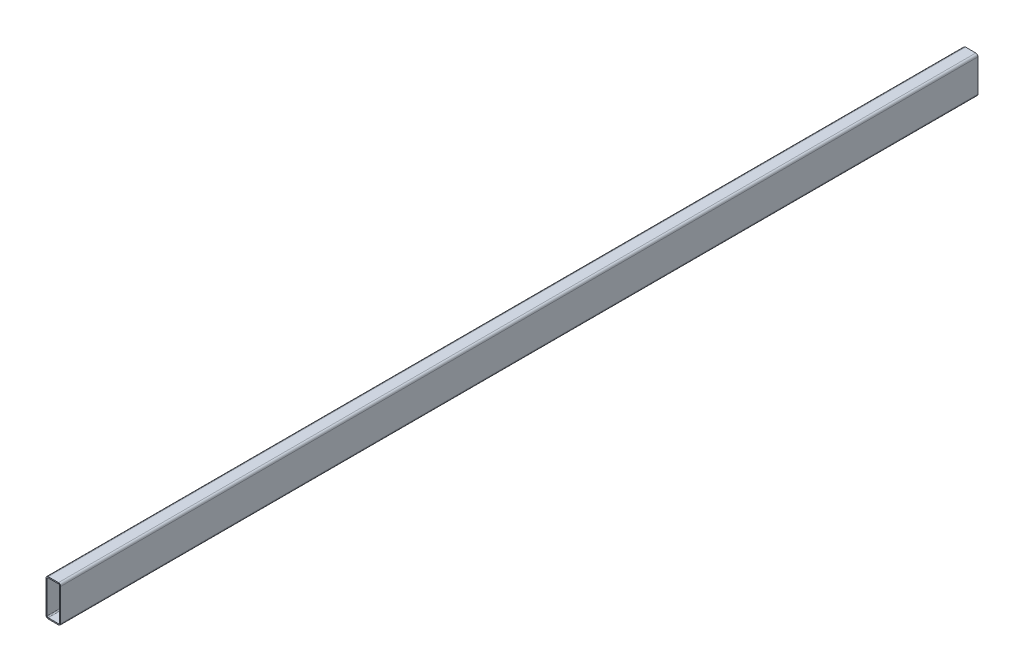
ISO-10303-21;
HEADER;
FILE_DESCRIPTION(('STEP AP214'),'2;1');
FILE_NAME('part.step','',(''),(''),'','','');
FILE_SCHEMA(('AUTOMOTIVE_DESIGN { 1 0 10303 214 1 1 1 1 }'));
ENDSEC;
DATA;
#1=APPLICATION_CONTEXT('core data for automotive mechanical design processes');
#2=APPLICATION_PROTOCOL_DEFINITION('international standard','automotive_design',2000,#1);
#3=PRODUCT_CONTEXT('',#1,'mechanical');
#4=PRODUCT('Part','Part','',(#3));
#5=PRODUCT_RELATED_PRODUCT_CATEGORY('part','',(#4));
#6=PRODUCT_DEFINITION_FORMATION('','',#4);
#7=PRODUCT_DEFINITION_CONTEXT('part definition',#1,'design');
#8=PRODUCT_DEFINITION('design','',#6,#7);
#9=PRODUCT_DEFINITION_SHAPE('','',#8);
#10=(LENGTH_UNIT() NAMED_UNIT(*) SI_UNIT(.MILLI.,.METRE.));
#11=(NAMED_UNIT(*) PLANE_ANGLE_UNIT() SI_UNIT($,.RADIAN.));
#12=(NAMED_UNIT(*) SI_UNIT($,.STERADIAN.) SOLID_ANGLE_UNIT());
#13=UNCERTAINTY_MEASURE_WITH_UNIT(LENGTH_MEASURE(1.E-05),#10,'distance_accuracy_value','');
#14=(GEOMETRIC_REPRESENTATION_CONTEXT(3) GLOBAL_UNCERTAINTY_ASSIGNED_CONTEXT((#13)) GLOBAL_UNIT_ASSIGNED_CONTEXT((#10,
#11,#12)) REPRESENTATION_CONTEXT('',''));
#15=CARTESIAN_POINT('',(0.,0.,0.));
#16=DIRECTION('',(0.,0.,1.));
#17=DIRECTION('',(1.,0.,0.));
#18=AXIS2_PLACEMENT_3D('',#15,#16,#17);
#19=CARTESIAN_POINT('',(6.,94.,2500.));
#20=DIRECTION('',(0.,0.,-1.));
#21=DIRECTION('',(-1.,0.,0.));
#22=AXIS2_PLACEMENT_3D('',#19,#20,#21);
#23=PLANE('',#22);
#24=CARTESIAN_POINT('',(6.,94.,2500.));
#25=DIRECTION('',(0.,0.,1.));
#26=DIRECTION('',(-1.,0.,0.));
#27=AXIS2_PLACEMENT_3D('',#24,#25,#26);
#28=CIRCLE('',#27,6.);
#29=CARTESIAN_POINT('',(6.00000000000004,100.,2500.));
#30=VERTEX_POINT('',#29);
#31=CARTESIAN_POINT('',(0.,94.,2500.));
#32=VERTEX_POINT('',#31);
#33=EDGE_CURVE('E217',#30,#32,#28,.T.);
#34=ORIENTED_EDGE('',*,*,#33,.T.);
#35=DIRECTION('',(0.,-1.,0.));
#36=VECTOR('',#35,1.);
#37=CARTESIAN_POINT('',(0.,6.00000000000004,2500.));
#38=LINE('',#37,#36);
#39=CARTESIAN_POINT('',(0.,6.00000000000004,2500.));
#40=VERTEX_POINT('',#39);
#41=EDGE_CURVE('E220',#32,#40,#38,.T.);
#42=ORIENTED_EDGE('',*,*,#41,.T.);
#43=CARTESIAN_POINT('',(6.,6.,2500.));
#44=DIRECTION('',(0.,0.,1.));
#45=DIRECTION('',(1.,0.,0.));
#46=AXIS2_PLACEMENT_3D('',#43,#44,#45);
#47=CIRCLE('',#46,6.);
#48=CARTESIAN_POINT('',(6.00000000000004,0.,2500.));
#49=VERTEX_POINT('',#48);
#50=EDGE_CURVE('E222',#40,#49,#47,.T.);
#51=ORIENTED_EDGE('',*,*,#50,.T.);
#52=DIRECTION('',(1.,0.,0.));
#53=VECTOR('',#52,1.);
#54=CARTESIAN_POINT('',(6.00000000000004,0.,2500.));
#55=LINE('',#54,#53);
#56=CARTESIAN_POINT('',(34.,0.,2500.));
#57=VERTEX_POINT('',#56);
#58=EDGE_CURVE('E224',#49,#57,#55,.T.);
#59=ORIENTED_EDGE('',*,*,#58,.T.);
#60=CARTESIAN_POINT('',(34.,6.,2500.));
#61=DIRECTION('',(0.,0.,1.));
#62=DIRECTION('',(1.,0.,0.));
#63=AXIS2_PLACEMENT_3D('',#60,#61,#62);
#64=CIRCLE('',#63,6.);
#65=CARTESIAN_POINT('',(40.,6.00000000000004,2500.));
#66=VERTEX_POINT('',#65);
#67=EDGE_CURVE('E226',#57,#66,#64,.T.);
#68=ORIENTED_EDGE('',*,*,#67,.T.);
#69=DIRECTION('',(0.,1.,0.));
#70=VECTOR('',#69,1.);
#71=CARTESIAN_POINT('',(40.,6.00000000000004,2500.));
#72=LINE('',#71,#70);
#73=CARTESIAN_POINT('',(40.,94.,2500.));
#74=VERTEX_POINT('',#73);
#75=EDGE_CURVE('E228',#66,#74,#72,.T.);
#76=ORIENTED_EDGE('',*,*,#75,.T.);
#77=CARTESIAN_POINT('',(34.,94.,2500.));
#78=DIRECTION('',(0.,0.,1.));
#79=DIRECTION('',(1.,0.,0.));
#80=AXIS2_PLACEMENT_3D('',#77,#78,#79);
#81=CIRCLE('',#80,6.);
#82=CARTESIAN_POINT('',(34.,100.,2500.));
#83=VERTEX_POINT('',#82);
#84=EDGE_CURVE('E230',#74,#83,#81,.T.);
#85=ORIENTED_EDGE('',*,*,#84,.T.);
#86=DIRECTION('',(-1.,0.,0.));
#87=VECTOR('',#86,1.);
#88=CARTESIAN_POINT('',(6.00000000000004,100.,2500.));
#89=LINE('',#88,#87);
#90=EDGE_CURVE('E232',#83,#30,#89,.T.);
#91=ORIENTED_EDGE('',*,*,#90,.T.);
#92=EDGE_LOOP('',(#34,#42,#51,#59,#68,#76,#85,#91));
#93=FACE_BOUND('',#92,.T.);
#94=CARTESIAN_POINT('',(6.,94.,2500.));
#95=DIRECTION('',(0.,0.,1.));
#96=DIRECTION('',(1.,0.,0.));
#97=AXIS2_PLACEMENT_3D('',#94,#95,#96);
#98=CIRCLE('',#97,3.);
#99=CARTESIAN_POINT('',(6.00000000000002,97.,2500.));
#100=VERTEX_POINT('',#99);
#101=CARTESIAN_POINT('',(3.,94.,2500.));
#102=VERTEX_POINT('',#101);
#103=EDGE_CURVE('E152',#100,#102,#98,.T.);
#104=ORIENTED_EDGE('',*,*,#103,.F.);
#105=DIRECTION('',(-1.,0.,0.));
#106=VECTOR('',#105,1.);
#107=CARTESIAN_POINT('',(6.00000000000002,97.,2500.));
#108=LINE('',#107,#106);
#109=CARTESIAN_POINT('',(34.,97.,2500.));
#110=VERTEX_POINT('',#109);
#111=EDGE_CURVE('E187',#110,#100,#108,.T.);
#112=ORIENTED_EDGE('',*,*,#111,.F.);
#113=CARTESIAN_POINT('',(34.,94.,2500.));
#114=DIRECTION('',(0.,0.,1.));
#115=DIRECTION('',(1.,0.,0.));
#116=AXIS2_PLACEMENT_3D('',#113,#114,#115);
#117=CIRCLE('',#116,3.);
#118=CARTESIAN_POINT('',(37.,94.,2500.));
#119=VERTEX_POINT('',#118);
#120=EDGE_CURVE('E185',#119,#110,#117,.T.);
#121=ORIENTED_EDGE('',*,*,#120,.F.);
#122=DIRECTION('',(0.,1.,0.));
#123=VECTOR('',#122,1.);
#124=CARTESIAN_POINT('',(37.,6.00000000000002,2500.));
#125=LINE('',#124,#123);
#126=CARTESIAN_POINT('',(37.,6.00000000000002,2500.));
#127=VERTEX_POINT('',#126);
#128=EDGE_CURVE('E183',#127,#119,#125,.T.);
#129=ORIENTED_EDGE('',*,*,#128,.F.);
#130=CARTESIAN_POINT('',(34.,6.,2500.));
#131=DIRECTION('',(0.,0.,1.));
#132=DIRECTION('',(1.,0.,0.));
#133=AXIS2_PLACEMENT_3D('',#130,#131,#132);
#134=CIRCLE('',#133,3.);
#135=CARTESIAN_POINT('',(34.,3.,2500.));
#136=VERTEX_POINT('',#135);
#137=EDGE_CURVE('E181',#136,#127,#134,.T.);
#138=ORIENTED_EDGE('',*,*,#137,.F.);
#139=DIRECTION('',(1.,0.,0.));
#140=VECTOR('',#139,1.);
#141=CARTESIAN_POINT('',(6.00000000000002,3.,2500.));
#142=LINE('',#141,#140);
#143=CARTESIAN_POINT('',(6.00000000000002,3.,2500.));
#144=VERTEX_POINT('',#143);
#145=EDGE_CURVE('E179',#144,#136,#142,.T.);
#146=ORIENTED_EDGE('',*,*,#145,.F.);
#147=CARTESIAN_POINT('',(6.,6.,2500.));
#148=DIRECTION('',(0.,0.,1.));
#149=DIRECTION('',(1.,0.,0.));
#150=AXIS2_PLACEMENT_3D('',#147,#148,#149);
#151=CIRCLE('',#150,3.);
#152=CARTESIAN_POINT('',(3.,6.00000000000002,2500.));
#153=VERTEX_POINT('',#152);
#154=EDGE_CURVE('E177',#153,#144,#151,.T.);
#155=ORIENTED_EDGE('',*,*,#154,.F.);
#156=DIRECTION('',(0.,-1.,0.));
#157=VECTOR('',#156,1.);
#158=CARTESIAN_POINT('',(3.,6.00000000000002,2500.));
#159=LINE('',#158,#157);
#160=EDGE_CURVE('E175',#102,#153,#159,.T.);
#161=ORIENTED_EDGE('',*,*,#160,.F.);
#162=EDGE_LOOP('',(#104,#112,#121,#129,#138,#146,#155,#161));
#163=FACE_BOUND('',#162,.T.);
#164=ADVANCED_FACE('F24',(#93,#163),#23,.F.);
#165=CARTESIAN_POINT('',(6.,94.,0.));
#166=DIRECTION('',(0.,0.,-1.));
#167=DIRECTION('',(-1.,0.,0.));
#168=AXIS2_PLACEMENT_3D('',#165,#166,#167);
#169=PLANE('',#168);
#170=CARTESIAN_POINT('',(6.,94.,0.));
#171=DIRECTION('',(0.,0.,1.));
#172=DIRECTION('',(-1.,0.,0.));
#173=AXIS2_PLACEMENT_3D('',#170,#171,#172);
#174=CIRCLE('',#173,6.);
#175=CARTESIAN_POINT('',(6.00000000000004,100.,0.));
#176=VERTEX_POINT('',#175);
#177=CARTESIAN_POINT('',(0.,94.,0.));
#178=VERTEX_POINT('',#177);
#179=EDGE_CURVE('E153',#176,#178,#174,.T.);
#180=ORIENTED_EDGE('',*,*,#179,.F.);
#181=DIRECTION('',(-1.,0.,0.));
#182=VECTOR('',#181,1.);
#183=CARTESIAN_POINT('',(6.00000000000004,100.,0.));
#184=LINE('',#183,#182);
#185=CARTESIAN_POINT('',(34.,100.,0.));
#186=VERTEX_POINT('',#185);
#187=EDGE_CURVE('E215',#186,#176,#184,.T.);
#188=ORIENTED_EDGE('',*,*,#187,.F.);
#189=CARTESIAN_POINT('',(34.,94.,0.));
#190=DIRECTION('',(0.,0.,1.));
#191=DIRECTION('',(1.,0.,0.));
#192=AXIS2_PLACEMENT_3D('',#189,#190,#191);
#193=CIRCLE('',#192,6.);
#194=CARTESIAN_POINT('',(40.,94.,0.));
#195=VERTEX_POINT('',#194);
#196=EDGE_CURVE('E213',#195,#186,#193,.T.);
#197=ORIENTED_EDGE('',*,*,#196,.F.);
#198=DIRECTION('',(0.,1.,0.));
#199=VECTOR('',#198,1.);
#200=CARTESIAN_POINT('',(40.,6.00000000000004,0.));
#201=LINE('',#200,#199);
#202=CARTESIAN_POINT('',(40.,6.00000000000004,0.));
#203=VERTEX_POINT('',#202);
#204=EDGE_CURVE('E211',#203,#195,#201,.T.);
#205=ORIENTED_EDGE('',*,*,#204,.F.);
#206=CARTESIAN_POINT('',(34.,6.,0.));
#207=DIRECTION('',(0.,0.,1.));
#208=DIRECTION('',(1.,0.,0.));
#209=AXIS2_PLACEMENT_3D('',#206,#207,#208);
#210=CIRCLE('',#209,6.);
#211=CARTESIAN_POINT('',(34.,0.,0.));
#212=VERTEX_POINT('',#211);
#213=EDGE_CURVE('E209',#212,#203,#210,.T.);
#214=ORIENTED_EDGE('',*,*,#213,.F.);
#215=DIRECTION('',(1.,0.,0.));
#216=VECTOR('',#215,1.);
#217=CARTESIAN_POINT('',(6.00000000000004,0.,0.));
#218=LINE('',#217,#216);
#219=CARTESIAN_POINT('',(6.00000000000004,0.,0.));
#220=VERTEX_POINT('',#219);
#221=EDGE_CURVE('E207',#220,#212,#218,.T.);
#222=ORIENTED_EDGE('',*,*,#221,.F.);
#223=CARTESIAN_POINT('',(6.,6.,0.));
#224=DIRECTION('',(0.,0.,1.));
#225=DIRECTION('',(1.,0.,0.));
#226=AXIS2_PLACEMENT_3D('',#223,#224,#225);
#227=CIRCLE('',#226,6.);
#228=CARTESIAN_POINT('',(0.,6.00000000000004,0.));
#229=VERTEX_POINT('',#228);
#230=EDGE_CURVE('E205',#229,#220,#227,.T.);
#231=ORIENTED_EDGE('',*,*,#230,.F.);
#232=DIRECTION('',(0.,-1.,0.));
#233=VECTOR('',#232,1.);
#234=CARTESIAN_POINT('',(0.,6.00000000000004,0.));
#235=LINE('',#234,#233);
#236=EDGE_CURVE('E203',#178,#229,#235,.T.);
#237=ORIENTED_EDGE('',*,*,#236,.F.);
#238=EDGE_LOOP('',(#180,#188,#197,#205,#214,#222,#231,#237));
#239=FACE_BOUND('',#238,.T.);
#240=DIRECTION('',(-1.,0.,0.));
#241=VECTOR('',#240,1.);
#242=CARTESIAN_POINT('',(6.00000000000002,97.,0.));
#243=LINE('',#242,#241);
#244=CARTESIAN_POINT('',(34.,97.,0.));
#245=VERTEX_POINT('',#244);
#246=CARTESIAN_POINT('',(6.00000000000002,97.,0.));
#247=VERTEX_POINT('',#246);
#248=EDGE_CURVE('E158',#245,#247,#243,.T.);
#249=ORIENTED_EDGE('',*,*,#248,.T.);
#250=CARTESIAN_POINT('',(6.,94.,0.));
#251=DIRECTION('',(0.,0.,1.));
#252=DIRECTION('',(1.,0.,0.));
#253=AXIS2_PLACEMENT_3D('',#250,#251,#252);
#254=CIRCLE('',#253,3.);
#255=CARTESIAN_POINT('',(3.,94.,0.));
#256=VERTEX_POINT('',#255);
#257=EDGE_CURVE('E47',#247,#256,#254,.T.);
#258=ORIENTED_EDGE('',*,*,#257,.T.);
#259=DIRECTION('',(0.,-1.,0.));
#260=VECTOR('',#259,1.);
#261=CARTESIAN_POINT('',(3.,6.00000000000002,0.));
#262=LINE('',#261,#260);
#263=CARTESIAN_POINT('',(3.,6.00000000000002,0.));
#264=VERTEX_POINT('',#263);
#265=EDGE_CURVE('E139',#256,#264,#262,.T.);
#266=ORIENTED_EDGE('',*,*,#265,.T.);
#267=CARTESIAN_POINT('',(6.,6.,0.));
#268=DIRECTION('',(0.,0.,1.));
#269=DIRECTION('',(1.,0.,0.));
#270=AXIS2_PLACEMENT_3D('',#267,#268,#269);
#271=CIRCLE('',#270,3.);
#272=CARTESIAN_POINT('',(6.00000000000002,3.,0.));
#273=VERTEX_POINT('',#272);
#274=EDGE_CURVE('E148',#264,#273,#271,.T.);
#275=ORIENTED_EDGE('',*,*,#274,.T.);
#276=DIRECTION('',(1.,0.,0.));
#277=VECTOR('',#276,1.);
#278=CARTESIAN_POINT('',(6.00000000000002,3.,0.));
#279=LINE('',#278,#277);
#280=CARTESIAN_POINT('',(34.,3.,0.));
#281=VERTEX_POINT('',#280);
#282=EDGE_CURVE('E162',#273,#281,#279,.T.);
#283=ORIENTED_EDGE('',*,*,#282,.T.);
#284=CARTESIAN_POINT('',(34.,6.,0.));
#285=DIRECTION('',(0.,0.,1.));
#286=DIRECTION('',(1.,0.,0.));
#287=AXIS2_PLACEMENT_3D('',#284,#285,#286);
#288=CIRCLE('',#287,3.);
#289=CARTESIAN_POINT('',(37.,6.00000000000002,0.));
#290=VERTEX_POINT('',#289);
#291=EDGE_CURVE('E165',#281,#290,#288,.T.);
#292=ORIENTED_EDGE('',*,*,#291,.T.);
#293=DIRECTION('',(0.,1.,0.));
#294=VECTOR('',#293,1.);
#295=CARTESIAN_POINT('',(37.,6.00000000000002,0.));
#296=LINE('',#295,#294);
#297=CARTESIAN_POINT('',(37.,94.,0.));
#298=VERTEX_POINT('',#297);
#299=EDGE_CURVE('E168',#290,#298,#296,.T.);
#300=ORIENTED_EDGE('',*,*,#299,.T.);
#301=CARTESIAN_POINT('',(34.,94.,0.));
#302=DIRECTION('',(0.,0.,1.));
#303=DIRECTION('',(1.,0.,0.));
#304=AXIS2_PLACEMENT_3D('',#301,#302,#303);
#305=CIRCLE('',#304,3.);
#306=EDGE_CURVE('E171',#298,#245,#305,.T.);
#307=ORIENTED_EDGE('',*,*,#306,.T.);
#308=EDGE_LOOP('',(#249,#258,#266,#275,#283,#292,#300,#307));
#309=FACE_BOUND('',#308,.T.);
#310=ADVANCED_FACE('F156',(#239,#309),#169,.T.);
#311=CARTESIAN_POINT('',(6.,94.,2500.));
#312=DIRECTION('',(0.,0.,-1.));
#313=DIRECTION('',(-1.,0.,0.));
#314=AXIS2_PLACEMENT_3D('',#311,#312,#313);
#315=CYLINDRICAL_SURFACE('',#314,6.);
#316=ORIENTED_EDGE('',*,*,#179,.T.);
#317=DIRECTION('',(0.,0.,-1.));
#318=VECTOR('',#317,1.);
#319=CARTESIAN_POINT('',(0.,94.,2500.));
#320=LINE('',#319,#318);
#321=EDGE_CURVE('E11',#32,#178,#320,.T.);
#322=ORIENTED_EDGE('',*,*,#321,.F.);
#323=ORIENTED_EDGE('',*,*,#33,.F.);
#324=DIRECTION('',(0.,0.,-1.));
#325=VECTOR('',#324,1.);
#326=CARTESIAN_POINT('',(6.00000000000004,100.,2500.));
#327=LINE('',#326,#325);
#328=EDGE_CURVE('E234',#30,#176,#327,.T.);
#329=ORIENTED_EDGE('',*,*,#328,.T.);
#330=EDGE_LOOP('',(#316,#322,#323,#329));
#331=FACE_BOUND('',#330,.T.);
#332=ADVANCED_FACE('F26',(#331),#315,.T.);
#333=CARTESIAN_POINT('',(0.,6.00000000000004,2500.));
#334=DIRECTION('',(1.,0.,0.));
#335=DIRECTION('',(0.,0.,-1.));
#336=AXIS2_PLACEMENT_3D('',#333,#334,#335);
#337=PLANE('',#336);
#338=ORIENTED_EDGE('',*,*,#236,.T.);
#339=DIRECTION('',(0.,0.,-1.));
#340=VECTOR('',#339,1.);
#341=CARTESIAN_POINT('',(0.,6.00000000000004,2500.));
#342=LINE('',#341,#340);
#343=EDGE_CURVE('E32',#40,#229,#342,.T.);
#344=ORIENTED_EDGE('',*,*,#343,.F.);
#345=ORIENTED_EDGE('',*,*,#41,.F.);
#346=ORIENTED_EDGE('',*,*,#321,.T.);
#347=EDGE_LOOP('',(#338,#344,#345,#346));
#348=FACE_BOUND('',#347,.T.);
#349=ADVANCED_FACE('F278',(#348),#337,.F.);
#350=CARTESIAN_POINT('',(6.,6.,2500.));
#351=DIRECTION('',(0.,0.,-1.));
#352=DIRECTION('',(-1.,0.,0.));
#353=AXIS2_PLACEMENT_3D('',#350,#351,#352);
#354=CYLINDRICAL_SURFACE('',#353,6.);
#355=ORIENTED_EDGE('',*,*,#230,.T.);
#356=DIRECTION('',(0.,0.,-1.));
#357=VECTOR('',#356,1.);
#358=CARTESIAN_POINT('',(6.00000000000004,0.,2500.));
#359=LINE('',#358,#357);
#360=EDGE_CURVE('E249',#49,#220,#359,.T.);
#361=ORIENTED_EDGE('',*,*,#360,.F.);
#362=ORIENTED_EDGE('',*,*,#50,.F.);
#363=ORIENTED_EDGE('',*,*,#343,.T.);
#364=EDGE_LOOP('',(#355,#361,#362,#363));
#365=FACE_BOUND('',#364,.T.);
#366=ADVANCED_FACE('F256',(#365),#354,.T.);
#367=CARTESIAN_POINT('',(6.00000000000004,0.,2500.));
#368=DIRECTION('',(0.,1.,0.));
#369=DIRECTION('',(0.,0.,1.));
#370=AXIS2_PLACEMENT_3D('',#367,#368,#369);
#371=PLANE('',#370);
#372=ORIENTED_EDGE('',*,*,#221,.T.);
#373=DIRECTION('',(0.,0.,-1.));
#374=VECTOR('',#373,1.);
#375=CARTESIAN_POINT('',(34.,0.,2500.));
#376=LINE('',#375,#374);
#377=EDGE_CURVE('E246',#57,#212,#376,.T.);
#378=ORIENTED_EDGE('',*,*,#377,.F.);
#379=ORIENTED_EDGE('',*,*,#58,.F.);
#380=ORIENTED_EDGE('',*,*,#360,.T.);
#381=EDGE_LOOP('',(#372,#378,#379,#380));
#382=FACE_BOUND('',#381,.T.);
#383=ADVANCED_FACE('F266',(#382),#371,.F.);
#384=CARTESIAN_POINT('',(34.,6.,2500.));
#385=DIRECTION('',(0.,0.,-1.));
#386=DIRECTION('',(-1.,0.,0.));
#387=AXIS2_PLACEMENT_3D('',#384,#385,#386);
#388=CYLINDRICAL_SURFACE('',#387,6.);
#389=ORIENTED_EDGE('',*,*,#213,.T.);
#390=DIRECTION('',(0.,0.,-1.));
#391=VECTOR('',#390,1.);
#392=CARTESIAN_POINT('',(40.,6.00000000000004,2500.));
#393=LINE('',#392,#391);
#394=EDGE_CURVE('E243',#66,#203,#393,.T.);
#395=ORIENTED_EDGE('',*,*,#394,.F.);
#396=ORIENTED_EDGE('',*,*,#67,.F.);
#397=ORIENTED_EDGE('',*,*,#377,.T.);
#398=EDGE_LOOP('',(#389,#395,#396,#397));
#399=FACE_BOUND('',#398,.T.);
#400=ADVANCED_FACE('F270',(#399),#388,.T.);
#401=CARTESIAN_POINT('',(40.,6.00000000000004,2500.));
#402=DIRECTION('',(-1.,0.,0.));
#403=DIRECTION('',(0.,0.,1.));
#404=AXIS2_PLACEMENT_3D('',#401,#402,#403);
#405=PLANE('',#404);
#406=ORIENTED_EDGE('',*,*,#204,.T.);
#407=DIRECTION('',(0.,0.,-1.));
#408=VECTOR('',#407,1.);
#409=CARTESIAN_POINT('',(40.,94.,2500.));
#410=LINE('',#409,#408);
#411=EDGE_CURVE('E240',#74,#195,#410,.T.);
#412=ORIENTED_EDGE('',*,*,#411,.F.);
#413=ORIENTED_EDGE('',*,*,#75,.F.);
#414=ORIENTED_EDGE('',*,*,#394,.T.);
#415=EDGE_LOOP('',(#406,#412,#413,#414));
#416=FACE_BOUND('',#415,.T.);
#417=ADVANCED_FACE('F291',(#416),#405,.F.);
#418=CARTESIAN_POINT('',(34.,94.,2500.));
#419=DIRECTION('',(0.,0.,-1.));
#420=DIRECTION('',(-1.,0.,0.));
#421=AXIS2_PLACEMENT_3D('',#418,#419,#420);
#422=CYLINDRICAL_SURFACE('',#421,6.);
#423=ORIENTED_EDGE('',*,*,#196,.T.);
#424=DIRECTION('',(0.,0.,-1.));
#425=VECTOR('',#424,1.);
#426=CARTESIAN_POINT('',(34.,100.,2500.));
#427=LINE('',#426,#425);
#428=EDGE_CURVE('E237',#83,#186,#427,.T.);
#429=ORIENTED_EDGE('',*,*,#428,.F.);
#430=ORIENTED_EDGE('',*,*,#84,.F.);
#431=ORIENTED_EDGE('',*,*,#411,.T.);
#432=EDGE_LOOP('',(#423,#429,#430,#431));
#433=FACE_BOUND('',#432,.T.);
#434=ADVANCED_FACE('F289',(#433),#422,.T.);
#435=CARTESIAN_POINT('',(6.00000000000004,100.,2500.));
#436=DIRECTION('',(0.,-1.,0.));
#437=DIRECTION('',(0.,0.,-1.));
#438=AXIS2_PLACEMENT_3D('',#435,#436,#437);
#439=PLANE('',#438);
#440=ORIENTED_EDGE('',*,*,#187,.T.);
#441=ORIENTED_EDGE('',*,*,#328,.F.);
#442=ORIENTED_EDGE('',*,*,#90,.F.);
#443=ORIENTED_EDGE('',*,*,#428,.T.);
#444=EDGE_LOOP('',(#440,#441,#442,#443));
#445=FACE_BOUND('',#444,.T.);
#446=ADVANCED_FACE('F284',(#445),#439,.F.);
#447=CARTESIAN_POINT('',(6.,94.,2500.));
#448=DIRECTION('',(0.,0.,-1.));
#449=DIRECTION('',(-1.,0.,0.));
#450=AXIS2_PLACEMENT_3D('',#447,#448,#449);
#451=CYLINDRICAL_SURFACE('',#450,3.);
#452=ORIENTED_EDGE('',*,*,#257,.F.);
#453=DIRECTION('',(0.,0.,-1.));
#454=VECTOR('',#453,1.);
#455=CARTESIAN_POINT('',(6.00000000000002,97.,2500.));
#456=LINE('',#455,#454);
#457=EDGE_CURVE('E189',#100,#247,#456,.T.);
#458=ORIENTED_EDGE('',*,*,#457,.F.);
#459=ORIENTED_EDGE('',*,*,#103,.T.);
#460=DIRECTION('',(0.,0.,-1.));
#461=VECTOR('',#460,1.);
#462=CARTESIAN_POINT('',(3.,94.,2500.));
#463=LINE('',#462,#461);
#464=EDGE_CURVE('E141',#102,#256,#463,.T.);
#465=ORIENTED_EDGE('',*,*,#464,.T.);
#466=EDGE_LOOP('',(#452,#458,#459,#465));
#467=FACE_BOUND('',#466,.T.);
#468=ADVANCED_FACE('F150',(#467),#451,.F.);
#469=CARTESIAN_POINT('',(3.,6.00000000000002,2500.));
#470=DIRECTION('',(1.,0.,0.));
#471=DIRECTION('',(0.,0.,-1.));
#472=AXIS2_PLACEMENT_3D('',#469,#470,#471);
#473=PLANE('',#472);
#474=ORIENTED_EDGE('',*,*,#265,.F.);
#475=ORIENTED_EDGE('',*,*,#464,.F.);
#476=ORIENTED_EDGE('',*,*,#160,.T.);
#477=DIRECTION('',(0.,0.,-1.));
#478=VECTOR('',#477,1.);
#479=CARTESIAN_POINT('',(3.,6.00000000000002,2500.));
#480=LINE('',#479,#478);
#481=EDGE_CURVE('E144',#153,#264,#480,.T.);
#482=ORIENTED_EDGE('',*,*,#481,.T.);
#483=EDGE_LOOP('',(#474,#475,#476,#482));
#484=FACE_BOUND('',#483,.T.);
#485=ADVANCED_FACE('F140',(#484),#473,.T.);
#486=CARTESIAN_POINT('',(6.,6.,2500.));
#487=DIRECTION('',(0.,0.,-1.));
#488=DIRECTION('',(-1.,0.,0.));
#489=AXIS2_PLACEMENT_3D('',#486,#487,#488);
#490=CYLINDRICAL_SURFACE('',#489,3.);
#491=ORIENTED_EDGE('',*,*,#274,.F.);
#492=ORIENTED_EDGE('',*,*,#481,.F.);
#493=ORIENTED_EDGE('',*,*,#154,.T.);
#494=DIRECTION('',(0.,0.,-1.));
#495=VECTOR('',#494,1.);
#496=CARTESIAN_POINT('',(6.00000000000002,3.,2500.));
#497=LINE('',#496,#495);
#498=EDGE_CURVE('E198',#144,#273,#497,.T.);
#499=ORIENTED_EDGE('',*,*,#498,.T.);
#500=EDGE_LOOP('',(#491,#492,#493,#499));
#501=FACE_BOUND('',#500,.T.);
#502=ADVANCED_FACE('F315',(#501),#490,.F.);
#503=CARTESIAN_POINT('',(6.00000000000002,3.,2500.));
#504=DIRECTION('',(0.,1.,0.));
#505=DIRECTION('',(0.,0.,1.));
#506=AXIS2_PLACEMENT_3D('',#503,#504,#505);
#507=PLANE('',#506);
#508=ORIENTED_EDGE('',*,*,#282,.F.);
#509=ORIENTED_EDGE('',*,*,#498,.F.);
#510=ORIENTED_EDGE('',*,*,#145,.T.);
#511=DIRECTION('',(0.,0.,-1.));
#512=VECTOR('',#511,1.);
#513=CARTESIAN_POINT('',(34.,3.,2500.));
#514=LINE('',#513,#512);
#515=EDGE_CURVE('E196',#136,#281,#514,.T.);
#516=ORIENTED_EDGE('',*,*,#515,.T.);
#517=EDGE_LOOP('',(#508,#509,#510,#516));
#518=FACE_BOUND('',#517,.T.);
#519=ADVANCED_FACE('F320',(#518),#507,.T.);
#520=CARTESIAN_POINT('',(34.,6.,2500.));
#521=DIRECTION('',(0.,0.,-1.));
#522=DIRECTION('',(-1.,0.,0.));
#523=AXIS2_PLACEMENT_3D('',#520,#521,#522);
#524=CYLINDRICAL_SURFACE('',#523,3.);
#525=ORIENTED_EDGE('',*,*,#291,.F.);
#526=ORIENTED_EDGE('',*,*,#515,.F.);
#527=ORIENTED_EDGE('',*,*,#137,.T.);
#528=DIRECTION('',(0.,0.,-1.));
#529=VECTOR('',#528,1.);
#530=CARTESIAN_POINT('',(37.,6.00000000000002,2500.));
#531=LINE('',#530,#529);
#532=EDGE_CURVE('E194',#127,#290,#531,.T.);
#533=ORIENTED_EDGE('',*,*,#532,.T.);
#534=EDGE_LOOP('',(#525,#526,#527,#533));
#535=FACE_BOUND('',#534,.T.);
#536=ADVANCED_FACE('F324',(#535),#524,.F.);
#537=CARTESIAN_POINT('',(37.,6.00000000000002,2500.));
#538=DIRECTION('',(-1.,0.,0.));
#539=DIRECTION('',(0.,0.,1.));
#540=AXIS2_PLACEMENT_3D('',#537,#538,#539);
#541=PLANE('',#540);
#542=ORIENTED_EDGE('',*,*,#299,.F.);
#543=ORIENTED_EDGE('',*,*,#532,.F.);
#544=ORIENTED_EDGE('',*,*,#128,.T.);
#545=DIRECTION('',(0.,0.,-1.));
#546=VECTOR('',#545,1.);
#547=CARTESIAN_POINT('',(37.,94.,2500.));
#548=LINE('',#547,#546);
#549=EDGE_CURVE('E192',#119,#298,#548,.T.);
#550=ORIENTED_EDGE('',*,*,#549,.T.);
#551=EDGE_LOOP('',(#542,#543,#544,#550));
#552=FACE_BOUND('',#551,.T.);
#553=ADVANCED_FACE('F328',(#552),#541,.T.);
#554=CARTESIAN_POINT('',(34.,94.,2500.));
#555=DIRECTION('',(0.,0.,-1.));
#556=DIRECTION('',(-1.,0.,0.));
#557=AXIS2_PLACEMENT_3D('',#554,#555,#556);
#558=CYLINDRICAL_SURFACE('',#557,3.);
#559=ORIENTED_EDGE('',*,*,#306,.F.);
#560=ORIENTED_EDGE('',*,*,#549,.F.);
#561=ORIENTED_EDGE('',*,*,#120,.T.);
#562=DIRECTION('',(0.,0.,-1.));
#563=VECTOR('',#562,1.);
#564=CARTESIAN_POINT('',(34.,97.,2500.));
#565=LINE('',#564,#563);
#566=EDGE_CURVE('E39',#110,#245,#565,.T.);
#567=ORIENTED_EDGE('',*,*,#566,.T.);
#568=EDGE_LOOP('',(#559,#560,#561,#567));
#569=FACE_BOUND('',#568,.T.);
#570=ADVANCED_FACE('F332',(#569),#558,.F.);
#571=CARTESIAN_POINT('',(6.00000000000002,97.,2500.));
#572=DIRECTION('',(0.,-1.,0.));
#573=DIRECTION('',(0.,0.,-1.));
#574=AXIS2_PLACEMENT_3D('',#571,#572,#573);
#575=PLANE('',#574);
#576=ORIENTED_EDGE('',*,*,#248,.F.);
#577=ORIENTED_EDGE('',*,*,#566,.F.);
#578=ORIENTED_EDGE('',*,*,#111,.T.);
#579=ORIENTED_EDGE('',*,*,#457,.T.);
#580=EDGE_LOOP('',(#576,#577,#578,#579));
#581=FACE_BOUND('',#580,.T.);
#582=ADVANCED_FACE('F336',(#581),#575,.T.);
#583=CLOSED_SHELL('',(#164,#310,#332,#349,#366,#383,#400,#417,#434,#446,#468,#485,#502,#519,
#536,#553,#570,#582));
#584=MANIFOLD_SOLID_BREP('B2',#583);
#585=ADVANCED_BREP_SHAPE_REPRESENTATION('',(#18,#584),#14);
#586=SHAPE_DEFINITION_REPRESENTATION(#9,#585);
ENDSEC;
END-ISO-10303-21;
